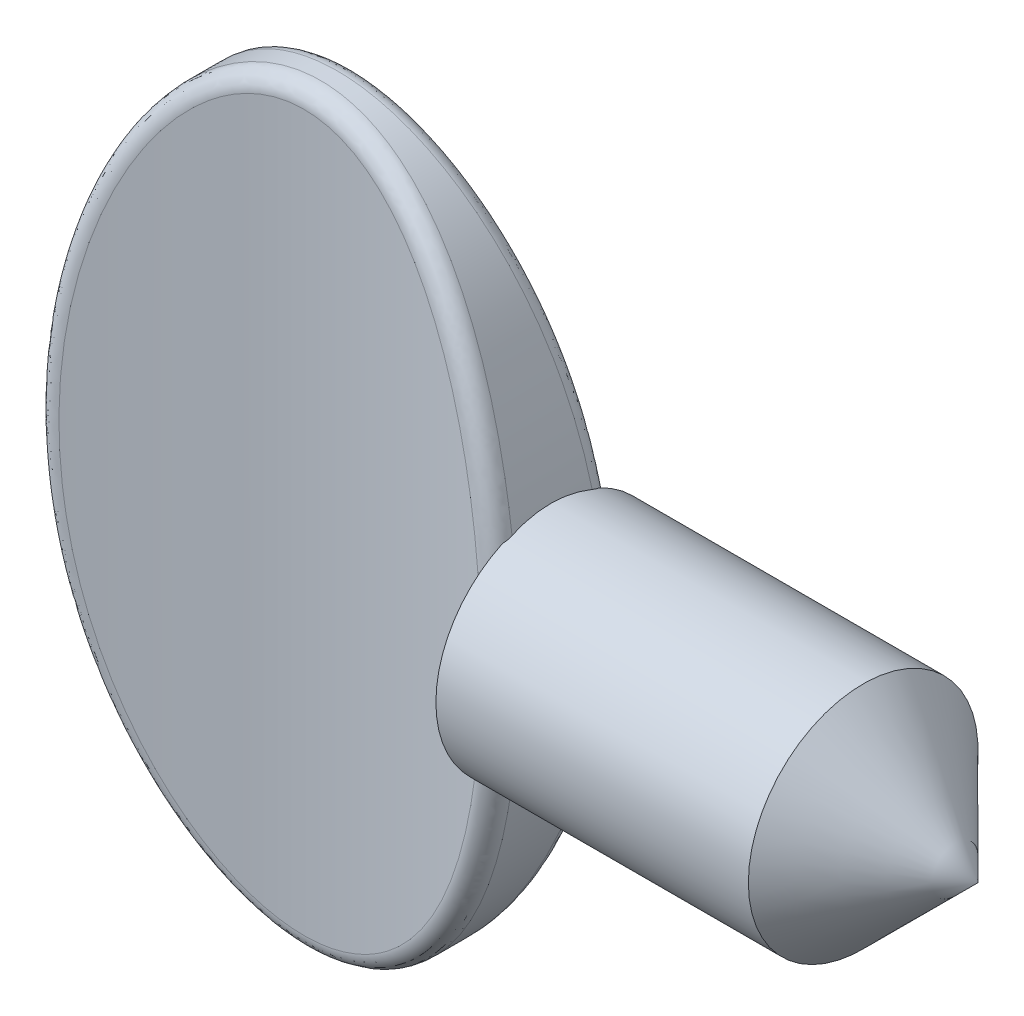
from build123d import *

# Parameters (mm, degrees)
SKETCH1_RX              = 5.715
SKETCH1_RY              = 3.556
EXTRUDE1_DEPTH          = 1.016
CUT_EXTRUDE1_DEPTH      = 7.8072473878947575
CUT_EXTRUDE1_DEPTH_BACK = 7.8072473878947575
SKETCH2_OUTSIDE_W       = 11.834000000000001
SKETCH2_OUTSIDE_H       = 6.754
FILLET3_R               = 0.254


with BuildPart() as part:
    # Sketch1 → Extrude1 (new, symmetric)
    with BuildSketch(Plane.XY):
        with Locations(Location((0, 0), (0, 0, -90))):
            Ellipse(SKETCH1_RX, SKETCH1_RY)
    extrude(amount=EXTRUDE1_DEPTH, both=True)

    # Sketch2 outside → Cut-Extrude1 (cut, two sides: drawn at the far end of the back side and taken through both)
    with BuildSketch(Plane(origin=(0, 0, 0), x_dir=(1, 0, 0), z_dir=(0, 1, 0)).offset(-CUT_EXTRUDE1_DEPTH_BACK)):
        Rectangle(SKETCH2_OUTSIDE_W, SKETCH2_OUTSIDE_H)
        with BuildLine():
            Line((-3.556, 1.016), (-3.556, -1.016))
            ThreePointArc((-3.556, -1.016), (6.3e-16, -0.3810000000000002), (3.556, -1.016))
            Line((3.556, -1.016), (3.556, 1.016))
            ThreePointArc((3.556, 1.016), (6.3e-16, 0.3810000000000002), (-3.556, 1.016))
        make_face(mode=Mode.SUBTRACT)
    extrude(amount=CUT_EXTRUDE1_DEPTH + CUT_EXTRUDE1_DEPTH_BACK, mode=Mode.SUBTRACT)

    # Fillet3
    fillet3_edges = [part.edges().sort_by_distance(p)[0] for p in [
        (-2.772297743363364, -3.579097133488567, 0.7620899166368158),
        (6.761380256e-08, 5.714999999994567, -0.38099999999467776),
    ]]
    fillet(fillet3_edges, radius=FILLET3_R)

    # Sketch3 → Revolve1 (revolve)
    with BuildSketch(Plane(origin=(0, 0, 0), x_dir=(1, 0, 0), z_dir=(0, 1, 0)), mode=Mode.PRIVATE) as revolve1_sk:
        with BuildLine():
            Line((9.906, 0), (8.15339999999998, 1.7525999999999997))
            Line((8.15339999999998, 1.7525999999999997), (4.741333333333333, 1.7526))
            Line((4.741333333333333, 1.7526), (3.3846611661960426, 1.7526000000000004))
            ThreePointArc((3.3846611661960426, 1.7526000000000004), (3.1592934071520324, 1.093146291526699), (2.577464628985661, 0.7095513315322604))
            Line((2.577464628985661, 0.7095513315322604), (2.577464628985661, 1e-17))
            Line((2.577464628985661, 1e-17), (9.906, 0))
        make_face()
    revolve(revolve1_sk.sketch.rotate(Axis((0, 0, 0), (1, 0, 0)), 180), axis=Axis((0, 0, 0), (1, 0, 0)))


solid = part.part
